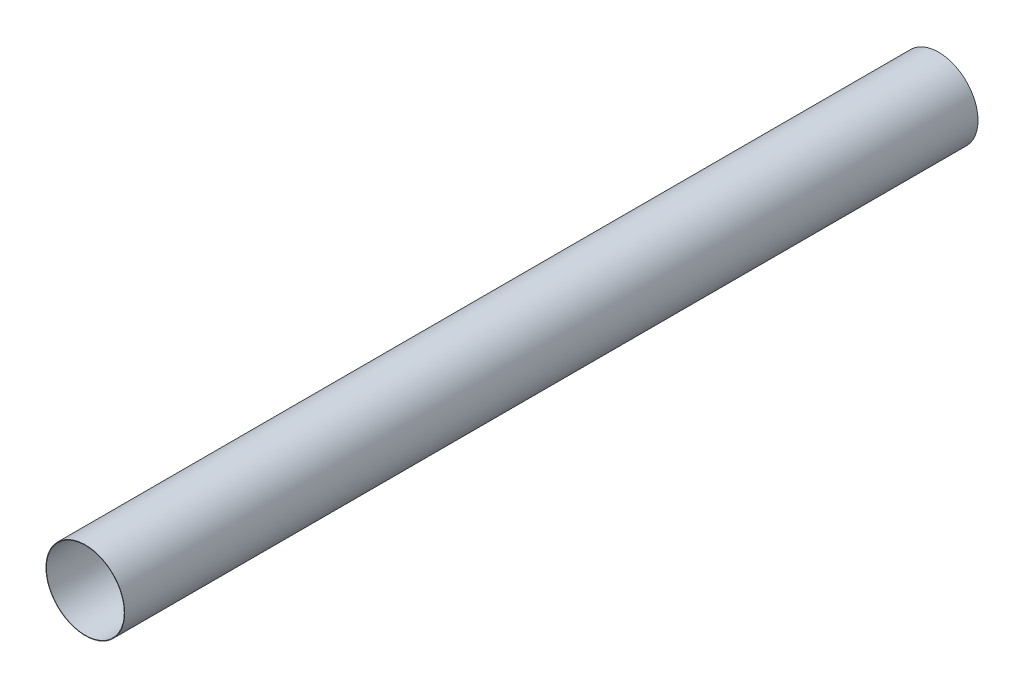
from build123d import *

# Parameters (mm, degrees)
SKETCH1_R           = 19.2
SKETCH1_R_2         = 19
BOSS_EXTRUDE1_DEPTH = 416


with BuildPart() as part:
    # Sketch1 → Boss-Extrude1 (new body)
    with BuildSketch(Plane.XY):
        Circle(SKETCH1_R)
        Circle(SKETCH1_R_2, mode=Mode.SUBTRACT)
    extrude(amount=-BOSS_EXTRUDE1_DEPTH)


solid = part.part
